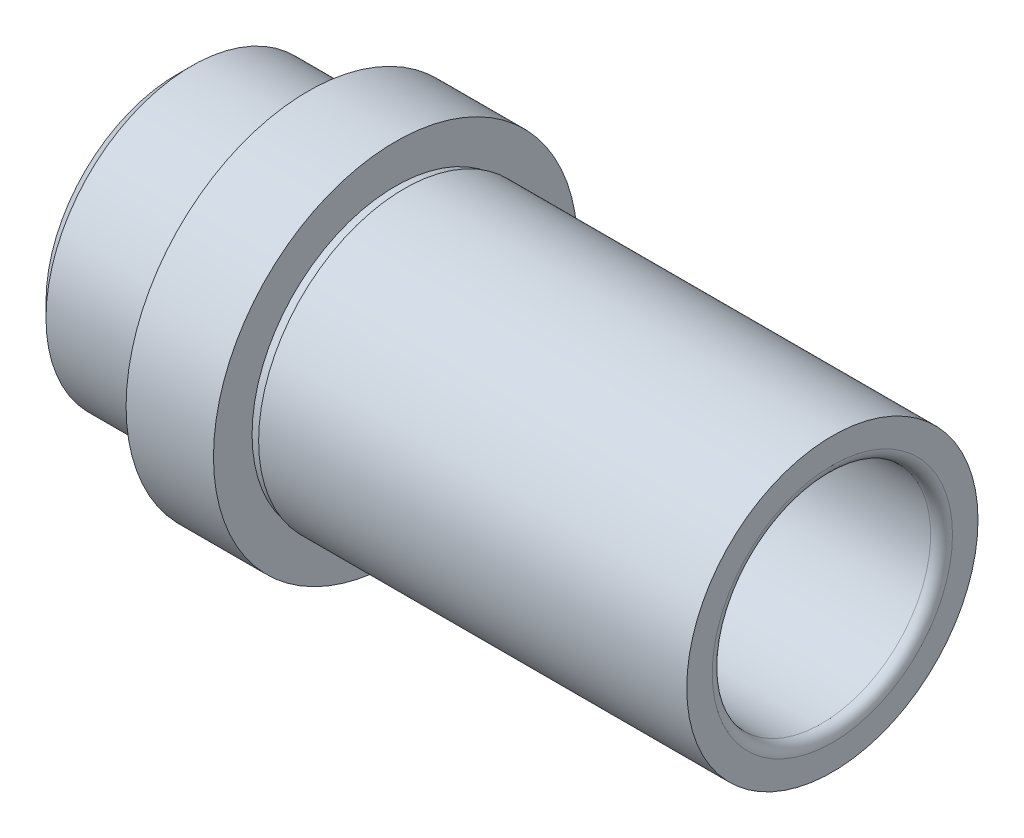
ISO-10303-21;
HEADER;
FILE_DESCRIPTION(('STEP AP214'),'2;1');
FILE_NAME('part.step','',(''),(''),'','','');
FILE_SCHEMA(('AUTOMOTIVE_DESIGN { 1 0 10303 214 1 1 1 1 }'));
ENDSEC;
DATA;
#1=APPLICATION_CONTEXT('core data for automotive mechanical design processes');
#2=APPLICATION_PROTOCOL_DEFINITION('international standard','automotive_design',2000,#1);
#3=PRODUCT_CONTEXT('',#1,'mechanical');
#4=PRODUCT('Part','Part','',(#3));
#5=PRODUCT_RELATED_PRODUCT_CATEGORY('part','',(#4));
#6=PRODUCT_DEFINITION_FORMATION('','',#4);
#7=PRODUCT_DEFINITION_CONTEXT('part definition',#1,'design');
#8=PRODUCT_DEFINITION('design','',#6,#7);
#9=PRODUCT_DEFINITION_SHAPE('','',#8);
#10=(LENGTH_UNIT() NAMED_UNIT(*) SI_UNIT(.MILLI.,.METRE.));
#11=(NAMED_UNIT(*) PLANE_ANGLE_UNIT() SI_UNIT($,.RADIAN.));
#12=(NAMED_UNIT(*) SI_UNIT($,.STERADIAN.) SOLID_ANGLE_UNIT());
#13=UNCERTAINTY_MEASURE_WITH_UNIT(LENGTH_MEASURE(1.E-05),#10,'distance_accuracy_value','');
#14=(GEOMETRIC_REPRESENTATION_CONTEXT(3) GLOBAL_UNCERTAINTY_ASSIGNED_CONTEXT((#13)) GLOBAL_UNIT_ASSIGNED_CONTEXT((#10,
#11,#12)) REPRESENTATION_CONTEXT('',''));
#15=CARTESIAN_POINT('',(0.,0.,0.));
#16=DIRECTION('',(0.,0.,1.));
#17=DIRECTION('',(1.,0.,0.));
#18=AXIS2_PLACEMENT_3D('',#15,#16,#17);
#19=CARTESIAN_POINT('',(-84.,17.,20.0000000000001));
#20=DIRECTION('',(-1.,0.,0.));
#21=DIRECTION('',(0.,0.,1.));
#22=AXIS2_PLACEMENT_3D('',#19,#20,#21);
#23=CONICAL_SURFACE('',#22,8.5,0.78539816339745);
#24=CARTESIAN_POINT('',(-83.,17.,20.0000000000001));
#25=DIRECTION('',(-1.,0.,0.));
#26=DIRECTION('',(0.,0.,1.));
#27=AXIS2_PLACEMENT_3D('',#24,#25,#26);
#28=CIRCLE('',#27,7.5);
#29=CARTESIAN_POINT('',(-83.,17.,27.5000000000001));
#30=VERTEX_POINT('',#29);
#31=EDGE_CURVE('E10',#30,#30,#28,.T.);
#32=ORIENTED_EDGE('',*,*,#31,.F.);
#33=EDGE_LOOP('',(#32));
#34=FACE_BOUND('',#33,.T.);
#35=CARTESIAN_POINT('',(-84.,17.,20.0000000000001));
#36=DIRECTION('',(-1.,0.,0.));
#37=DIRECTION('',(0.,0.,1.));
#38=AXIS2_PLACEMENT_3D('',#35,#36,#37);
#39=CIRCLE('',#38,8.5);
#40=CARTESIAN_POINT('',(-84.,17.,28.5000000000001));
#41=VERTEX_POINT('',#40);
#42=EDGE_CURVE('E63',#41,#41,#39,.T.);
#43=ORIENTED_EDGE('',*,*,#42,.T.);
#44=EDGE_LOOP('',(#43));
#45=FACE_BOUND('',#44,.T.);
#46=ADVANCED_FACE('F14',(#34,#45),#23,.F.);
#47=CARTESIAN_POINT('',(-39.,17.,20.));
#48=DIRECTION('',(-1.,0.,0.));
#49=DIRECTION('',(0.,0.,1.));
#50=AXIS2_PLACEMENT_3D('',#47,#48,#49);
#51=CYLINDRICAL_SURFACE('',#50,7.5);
#52=CARTESIAN_POINT('',(-39.75,17.,20.));
#53=DIRECTION('',(-1.,0.,0.));
#54=DIRECTION('',(0.,0.,1.));
#55=AXIS2_PLACEMENT_3D('',#52,#53,#54);
#56=CIRCLE('',#55,7.5);
#57=CARTESIAN_POINT('',(-39.75,17.,27.5));
#58=VERTEX_POINT('',#57);
#59=EDGE_CURVE('E20',#58,#58,#56,.T.);
#60=ORIENTED_EDGE('',*,*,#59,.F.);
#61=EDGE_LOOP('',(#60));
#62=FACE_BOUND('',#61,.T.);
#63=ORIENTED_EDGE('',*,*,#31,.T.);
#64=EDGE_LOOP('',(#63));
#65=FACE_BOUND('',#64,.T.);
#66=ADVANCED_FACE('F99',(#62,#65),#51,.F.);
#67=CARTESIAN_POINT('',(-39.75,17.,20.));
#68=DIRECTION('',(-1.,0.,0.));
#69=DIRECTION('',(0.,0.,1.));
#70=AXIS2_PLACEMENT_3D('',#67,#68,#69);
#71=TOROIDAL_SURFACE('',#70,8.25,0.75);
#72=CARTESIAN_POINT('',(-39.,17.,20.));
#73=DIRECTION('',(-1.,0.,0.));
#74=DIRECTION('',(0.,0.,1.));
#75=AXIS2_PLACEMENT_3D('',#72,#73,#74);
#76=CIRCLE('',#75,8.25);
#77=CARTESIAN_POINT('',(-39.,17.,28.25));
#78=VERTEX_POINT('',#77);
#79=EDGE_CURVE('E24',#78,#78,#76,.T.);
#80=ORIENTED_EDGE('',*,*,#79,.F.);
#81=EDGE_LOOP('',(#80));
#82=FACE_BOUND('',#81,.T.);
#83=ORIENTED_EDGE('',*,*,#59,.T.);
#84=EDGE_LOOP('',(#83));
#85=FACE_BOUND('',#84,.T.);
#86=ADVANCED_FACE('F104',(#82,#85),#71,.T.);
#87=CARTESIAN_POINT('',(-39.,25.25,20.));
#88=DIRECTION('',(-1.,0.,0.));
#89=DIRECTION('',(0.,0.,1.));
#90=AXIS2_PLACEMENT_3D('',#87,#88,#89);
#91=PLANE('',#90);
#92=CARTESIAN_POINT('',(-39.,17.,20.));
#93=DIRECTION('',(-1.,0.,0.));
#94=DIRECTION('',(0.,0.,1.));
#95=AXIS2_PLACEMENT_3D('',#92,#93,#94);
#96=CIRCLE('',#95,10.);
#97=CARTESIAN_POINT('',(-39.,17.,30.));
#98=VERTEX_POINT('',#97);
#99=EDGE_CURVE('E28',#98,#98,#96,.T.);
#100=ORIENTED_EDGE('',*,*,#99,.F.);
#101=EDGE_LOOP('',(#100));
#102=FACE_BOUND('',#101,.T.);
#103=ORIENTED_EDGE('',*,*,#79,.T.);
#104=EDGE_LOOP('',(#103));
#105=FACE_BOUND('',#104,.T.);
#106=ADVANCED_FACE('F109',(#102,#105),#91,.F.);
#107=CARTESIAN_POINT('',(-39.,17.,20.));
#108=DIRECTION('',(-1.,0.,0.));
#109=DIRECTION('',(0.,0.,1.));
#110=AXIS2_PLACEMENT_3D('',#107,#108,#109);
#111=CYLINDRICAL_SURFACE('',#110,10.);
#112=ORIENTED_EDGE('',*,*,#99,.T.);
#113=EDGE_LOOP('',(#112));
#114=FACE_BOUND('',#113,.T.);
#115=CARTESIAN_POINT('',(-68.4,17.,19.9999999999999));
#116=DIRECTION('',(-1.,0.,0.));
#117=DIRECTION('',(0.,0.,1.));
#118=AXIS2_PLACEMENT_3D('',#115,#116,#117);
#119=CIRCLE('',#118,10.);
#120=CARTESIAN_POINT('',(-68.4,17.,29.9999999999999));
#121=VERTEX_POINT('',#120);
#122=EDGE_CURVE('E33',#121,#121,#119,.T.);
#123=ORIENTED_EDGE('',*,*,#122,.F.);
#124=EDGE_LOOP('',(#123));
#125=FACE_BOUND('',#124,.T.);
#126=ADVANCED_FACE('F115',(#114,#125),#111,.T.);
#127=CARTESIAN_POINT('',(-68.4,27.,19.9999999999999));
#128=DIRECTION('',(1.,0.,0.));
#129=DIRECTION('',(0.,0.,-1.));
#130=AXIS2_PLACEMENT_3D('',#127,#128,#129);
#131=PLANE('',#130);
#132=CARTESIAN_POINT('',(-68.4,17.,19.9999999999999));
#133=DIRECTION('',(-1.,0.,0.));
#134=DIRECTION('',(0.,0.,1.));
#135=AXIS2_PLACEMENT_3D('',#132,#133,#134);
#136=CIRCLE('',#135,9.85);
#137=CARTESIAN_POINT('',(-68.4,17.,29.8499999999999));
#138=VERTEX_POINT('',#137);
#139=EDGE_CURVE('E36',#138,#138,#136,.T.);
#140=ORIENTED_EDGE('',*,*,#139,.F.);
#141=EDGE_LOOP('',(#140));
#142=FACE_BOUND('',#141,.T.);
#143=ORIENTED_EDGE('',*,*,#122,.T.);
#144=EDGE_LOOP('',(#143));
#145=FACE_BOUND('',#144,.T.);
#146=ADVANCED_FACE('F119',(#142,#145),#131,.F.);
#147=CARTESIAN_POINT('',(-39.,17.,20.));
#148=DIRECTION('',(-1.,0.,0.));
#149=DIRECTION('',(0.,0.,1.));
#150=AXIS2_PLACEMENT_3D('',#147,#148,#149);
#151=CYLINDRICAL_SURFACE('',#150,9.85);
#152=ORIENTED_EDGE('',*,*,#139,.T.);
#153=EDGE_LOOP('',(#152));
#154=FACE_BOUND('',#153,.T.);
#155=CARTESIAN_POINT('',(-69.,17.,19.9999999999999));
#156=DIRECTION('',(-1.,0.,0.));
#157=DIRECTION('',(0.,0.,1.));
#158=AXIS2_PLACEMENT_3D('',#155,#156,#157);
#159=CIRCLE('',#158,9.85);
#160=CARTESIAN_POINT('',(-69.,17.,29.8499999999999));
#161=VERTEX_POINT('',#160);
#162=EDGE_CURVE('E39',#161,#161,#159,.T.);
#163=ORIENTED_EDGE('',*,*,#162,.F.);
#164=EDGE_LOOP('',(#163));
#165=FACE_BOUND('',#164,.T.);
#166=ADVANCED_FACE('F123',(#154,#165),#151,.T.);
#167=CARTESIAN_POINT('',(-69.,26.85,19.9999999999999));
#168=DIRECTION('',(-1.,0.,0.));
#169=DIRECTION('',(0.,0.,1.));
#170=AXIS2_PLACEMENT_3D('',#167,#168,#169);
#171=PLANE('',#170);
#172=CARTESIAN_POINT('',(-69.,17.,19.9999999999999));
#173=DIRECTION('',(-1.,0.,0.));
#174=DIRECTION('',(0.,0.,1.));
#175=AXIS2_PLACEMENT_3D('',#172,#173,#174);
#176=CIRCLE('',#175,12.5);
#177=CARTESIAN_POINT('',(-69.,17.,32.4999999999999));
#178=VERTEX_POINT('',#177);
#179=EDGE_CURVE('E42',#178,#178,#176,.T.);
#180=ORIENTED_EDGE('',*,*,#179,.F.);
#181=EDGE_LOOP('',(#180));
#182=FACE_BOUND('',#181,.T.);
#183=ORIENTED_EDGE('',*,*,#162,.T.);
#184=EDGE_LOOP('',(#183));
#185=FACE_BOUND('',#184,.T.);
#186=ADVANCED_FACE('F127',(#182,#185),#171,.F.);
#187=CARTESIAN_POINT('',(-39.,17.,20.));
#188=DIRECTION('',(-1.,0.,0.));
#189=DIRECTION('',(0.,0.,1.));
#190=AXIS2_PLACEMENT_3D('',#187,#188,#189);
#191=CYLINDRICAL_SURFACE('',#190,12.5);
#192=CARTESIAN_POINT('',(-75.,17.,19.9999999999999));
#193=DIRECTION('',(-1.,0.,0.));
#194=DIRECTION('',(0.,0.,1.));
#195=AXIS2_PLACEMENT_3D('',#192,#193,#194);
#196=CIRCLE('',#195,12.5);
#197=CARTESIAN_POINT('',(-75.,17.,32.4999999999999));
#198=VERTEX_POINT('',#197);
#199=EDGE_CURVE('E45',#198,#198,#196,.T.);
#200=ORIENTED_EDGE('',*,*,#199,.F.);
#201=EDGE_LOOP('',(#200));
#202=FACE_BOUND('',#201,.T.);
#203=ORIENTED_EDGE('',*,*,#179,.T.);
#204=EDGE_LOOP('',(#203));
#205=FACE_BOUND('',#204,.T.);
#206=ADVANCED_FACE('F131',(#202,#205),#191,.T.);
#207=CARTESIAN_POINT('',(-75.,29.5,19.9999999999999));
#208=DIRECTION('',(1.,0.,0.));
#209=DIRECTION('',(0.,0.,-1.));
#210=AXIS2_PLACEMENT_3D('',#207,#208,#209);
#211=PLANE('',#210);
#212=CARTESIAN_POINT('',(-75.,17.,19.9999999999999));
#213=DIRECTION('',(-1.,0.,0.));
#214=DIRECTION('',(0.,0.,1.));
#215=AXIS2_PLACEMENT_3D('',#212,#213,#214);
#216=CIRCLE('',#215,9.85);
#217=CARTESIAN_POINT('',(-75.,17.,29.8499999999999));
#218=VERTEX_POINT('',#217);
#219=EDGE_CURVE('E48',#218,#218,#216,.T.);
#220=ORIENTED_EDGE('',*,*,#219,.F.);
#221=EDGE_LOOP('',(#220));
#222=FACE_BOUND('',#221,.T.);
#223=ORIENTED_EDGE('',*,*,#199,.T.);
#224=EDGE_LOOP('',(#223));
#225=FACE_BOUND('',#224,.T.);
#226=ADVANCED_FACE('F95',(#222,#225),#211,.F.);
#227=CARTESIAN_POINT('',(-39.,17.,20.));
#228=DIRECTION('',(-1.,0.,0.));
#229=DIRECTION('',(0.,0.,1.));
#230=AXIS2_PLACEMENT_3D('',#227,#228,#229);
#231=CYLINDRICAL_SURFACE('',#230,9.85);
#232=CARTESIAN_POINT('',(-75.6,17.,19.9999999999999));
#233=DIRECTION('',(-1.,0.,0.));
#234=DIRECTION('',(0.,0.,1.));
#235=AXIS2_PLACEMENT_3D('',#232,#233,#234);
#236=CIRCLE('',#235,9.85);
#237=CARTESIAN_POINT('',(-75.6,17.,29.8499999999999));
#238=VERTEX_POINT('',#237);
#239=EDGE_CURVE('E51',#238,#238,#236,.T.);
#240=ORIENTED_EDGE('',*,*,#239,.F.);
#241=EDGE_LOOP('',(#240));
#242=FACE_BOUND('',#241,.T.);
#243=ORIENTED_EDGE('',*,*,#219,.T.);
#244=EDGE_LOOP('',(#243));
#245=FACE_BOUND('',#244,.T.);
#246=ADVANCED_FACE('F88',(#242,#245),#231,.T.);
#247=CARTESIAN_POINT('',(-75.6,27.,19.9999999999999));
#248=DIRECTION('',(1.,0.,0.));
#249=DIRECTION('',(0.,0.,-1.));
#250=AXIS2_PLACEMENT_3D('',#247,#248,#249);
#251=PLANE('',#250);
#252=ORIENTED_EDGE('',*,*,#239,.T.);
#253=EDGE_LOOP('',(#252));
#254=FACE_BOUND('',#253,.T.);
#255=CARTESIAN_POINT('',(-75.6,17.,19.9999999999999));
#256=DIRECTION('',(-1.,0.,0.));
#257=DIRECTION('',(0.,0.,1.));
#258=AXIS2_PLACEMENT_3D('',#255,#256,#257);
#259=CIRCLE('',#258,10.);
#260=CARTESIAN_POINT('',(-75.6,17.,29.9999999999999));
#261=VERTEX_POINT('',#260);
#262=EDGE_CURVE('E54',#261,#261,#259,.T.);
#263=ORIENTED_EDGE('',*,*,#262,.F.);
#264=EDGE_LOOP('',(#263));
#265=FACE_BOUND('',#264,.T.);
#266=ADVANCED_FACE('F83',(#254,#265),#251,.T.);
#267=CARTESIAN_POINT('',(-39.,17.,20.));
#268=DIRECTION('',(-1.,0.,0.));
#269=DIRECTION('',(0.,0.,1.));
#270=AXIS2_PLACEMENT_3D('',#267,#268,#269);
#271=CYLINDRICAL_SURFACE('',#270,10.);
#272=CARTESIAN_POINT('',(-83.,17.,20.0000000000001));
#273=DIRECTION('',(-1.,0.,0.));
#274=DIRECTION('',(0.,0.,1.));
#275=AXIS2_PLACEMENT_3D('',#272,#273,#274);
#276=CIRCLE('',#275,10.);
#277=CARTESIAN_POINT('',(-83.,17.,30.0000000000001));
#278=VERTEX_POINT('',#277);
#279=EDGE_CURVE('E57',#278,#278,#276,.T.);
#280=ORIENTED_EDGE('',*,*,#279,.F.);
#281=EDGE_LOOP('',(#280));
#282=FACE_BOUND('',#281,.T.);
#283=ORIENTED_EDGE('',*,*,#262,.T.);
#284=EDGE_LOOP('',(#283));
#285=FACE_BOUND('',#284,.T.);
#286=ADVANCED_FACE('F77',(#282,#285),#271,.T.);
#287=CARTESIAN_POINT('',(-83.,17.,20.0000000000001));
#288=DIRECTION('',(1.,0.,0.));
#289=DIRECTION('',(0.,0.,-1.));
#290=AXIS2_PLACEMENT_3D('',#287,#288,#289);
#291=CONICAL_SURFACE('',#290,10.,0.785398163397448);
#292=CARTESIAN_POINT('',(-84.,17.,20.0000000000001));
#293=DIRECTION('',(-1.,0.,0.));
#294=DIRECTION('',(0.,0.,1.));
#295=AXIS2_PLACEMENT_3D('',#292,#293,#294);
#296=CIRCLE('',#295,9.);
#297=CARTESIAN_POINT('',(-84.,17.,29.0000000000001));
#298=VERTEX_POINT('',#297);
#299=EDGE_CURVE('E60',#298,#298,#296,.T.);
#300=ORIENTED_EDGE('',*,*,#299,.F.);
#301=EDGE_LOOP('',(#300));
#302=FACE_BOUND('',#301,.T.);
#303=ORIENTED_EDGE('',*,*,#279,.T.);
#304=EDGE_LOOP('',(#303));
#305=FACE_BOUND('',#304,.T.);
#306=ADVANCED_FACE('F71',(#302,#305),#291,.T.);
#307=CARTESIAN_POINT('',(-84.,26.,20.0000000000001));
#308=DIRECTION('',(1.,0.,0.));
#309=DIRECTION('',(0.,0.,-1.));
#310=AXIS2_PLACEMENT_3D('',#307,#308,#309);
#311=PLANE('',#310);
#312=ORIENTED_EDGE('',*,*,#42,.F.);
#313=EDGE_LOOP('',(#312));
#314=FACE_BOUND('',#313,.T.);
#315=ORIENTED_EDGE('',*,*,#299,.T.);
#316=EDGE_LOOP('',(#315));
#317=FACE_BOUND('',#316,.T.);
#318=ADVANCED_FACE('F68',(#314,#317),#311,.F.);
#319=CLOSED_SHELL('',(#46,#66,#86,#106,#126,#146,#166,#186,#206,#226,#246,#266,#286,#306,#318));
#320=MANIFOLD_SOLID_BREP('B1',#319);
#321=ADVANCED_BREP_SHAPE_REPRESENTATION('',(#18,#320),#14);
#322=SHAPE_DEFINITION_REPRESENTATION(#9,#321);
ENDSEC;
END-ISO-10303-21;
